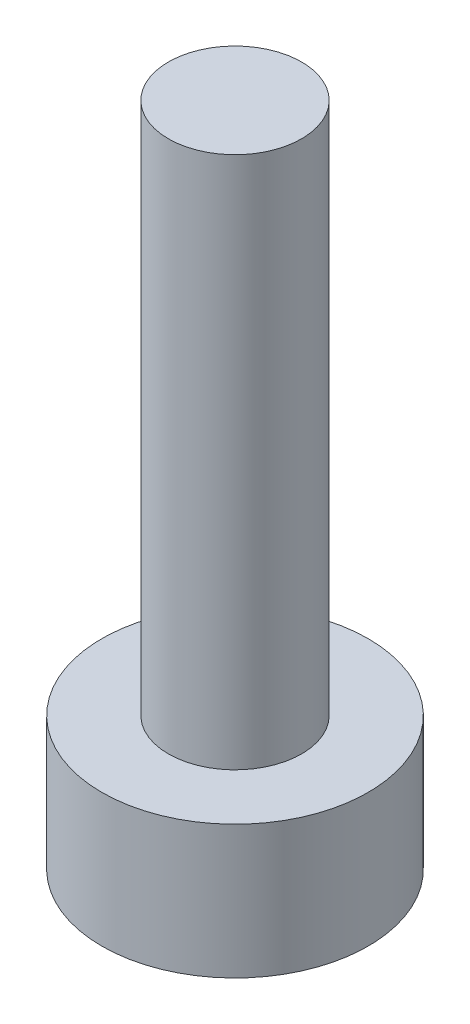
from build123d import *


with BuildPart() as part:
    # Esquisse1 → Base-R_volution (revolve)
    with BuildSketch(Plane.XY, mode=Mode.PRIVATE) as base_r_volution_sk:
        Polygon((0, 0), (-4, 0), (-4, 4), (-2, 4), (-2, 20), (0, 20), align=None)
    revolve(base_r_volution_sk.sketch.rotate(Axis((0, 49.432307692, 0), (0, -1, 0)), 270), axis=Axis((0, 49.432307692, 0), (0, -1, 0)))


solid = part.part
